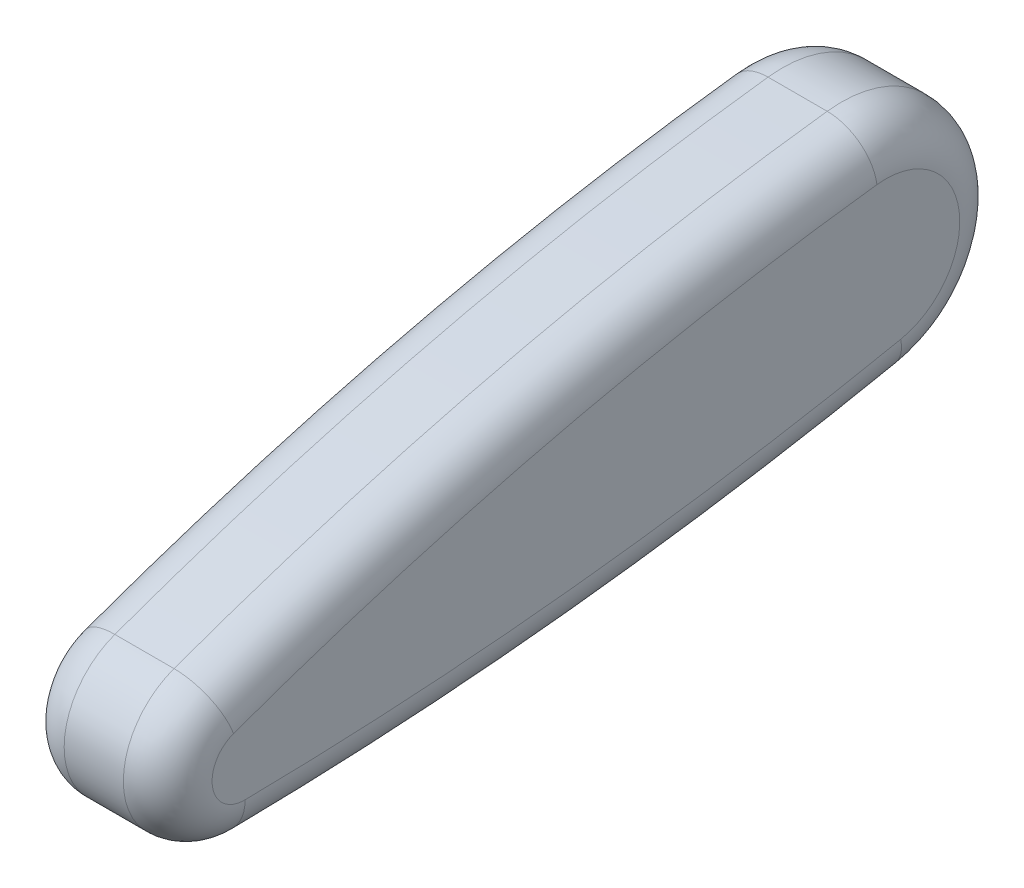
ISO-10303-21;
HEADER;
FILE_DESCRIPTION(('STEP AP214'),'2;1');
FILE_NAME('part.step','',(''),(''),'','','');
FILE_SCHEMA(('AUTOMOTIVE_DESIGN { 1 0 10303 214 1 1 1 1 }'));
ENDSEC;
DATA;
#1=APPLICATION_CONTEXT('core data for automotive mechanical design processes');
#2=APPLICATION_PROTOCOL_DEFINITION('international standard','automotive_design',2000,#1);
#3=PRODUCT_CONTEXT('',#1,'mechanical');
#4=PRODUCT('Part','Part','',(#3));
#5=PRODUCT_RELATED_PRODUCT_CATEGORY('part','',(#4));
#6=PRODUCT_DEFINITION_FORMATION('','',#4);
#7=PRODUCT_DEFINITION_CONTEXT('part definition',#1,'design');
#8=PRODUCT_DEFINITION('design','',#6,#7);
#9=PRODUCT_DEFINITION_SHAPE('','',#8);
#10=(LENGTH_UNIT() NAMED_UNIT(*) SI_UNIT(.MILLI.,.METRE.));
#11=(NAMED_UNIT(*) PLANE_ANGLE_UNIT() SI_UNIT($,.RADIAN.));
#12=(NAMED_UNIT(*) SI_UNIT($,.STERADIAN.) SOLID_ANGLE_UNIT());
#13=UNCERTAINTY_MEASURE_WITH_UNIT(LENGTH_MEASURE(1.E-05),#10,'distance_accuracy_value','');
#14=(GEOMETRIC_REPRESENTATION_CONTEXT(3) GLOBAL_UNCERTAINTY_ASSIGNED_CONTEXT((#13)) GLOBAL_UNIT_ASSIGNED_CONTEXT((#10,
#11,#12)) REPRESENTATION_CONTEXT('',''));
#15=CARTESIAN_POINT('',(0.,0.,0.));
#16=DIRECTION('',(0.,0.,1.));
#17=DIRECTION('',(1.,0.,0.));
#18=AXIS2_PLACEMENT_3D('',#15,#16,#17);
#19=CARTESIAN_POINT('',(-241.3,1358.74102949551,255.120761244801));
#20=DIRECTION('',(1.,0.,0.));
#21=DIRECTION('',(0.,0.,1.));
#22=AXIS2_PLACEMENT_3D('',#19,#20,#21);
#23=TOROIDAL_SURFACE('',#22,1504.95,19.05);
#24=CARTESIAN_POINT('',(-241.3,-146.069472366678,234.630373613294));
#25=DIRECTION('',(0.,0.0136153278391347,-0.999907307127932));
#26=DIRECTION('',(0.,-0.999907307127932,-0.0136153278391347));
#27=AXIS2_PLACEMENT_3D('',#24,#25,#26);
#28=CIRCLE('',#27,19.05);
#29=CARTESIAN_POINT('',(-222.25,-146.069472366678,234.630373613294));
#30=VERTEX_POINT('',#29);
#31=CARTESIAN_POINT('',(-241.3,-165.117706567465,234.371001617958));
#32=VERTEX_POINT('',#31);
#33=EDGE_CURVE('E11',#30,#32,#28,.T.);
#34=ORIENTED_EDGE('',*,*,#33,.T.);
#35=CARTESIAN_POINT('',(-241.3,1358.74102949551,255.120761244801));
#36=DIRECTION('',(-1.,0.,0.));
#37=DIRECTION('',(0.,0.,1.));
#38=AXIS2_PLACEMENT_3D('',#35,#36,#37);
#39=CIRCLE('',#38,1524.);
#40=CARTESIAN_POINT('',(-241.3,-134.261755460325,-50.6874860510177));
#41=VERTEX_POINT('',#40);
#42=EDGE_CURVE('E148',#32,#41,#39,.F.);
#43=ORIENTED_EDGE('',*,*,#42,.T.);
#44=CARTESIAN_POINT('',(-241.3,-115.599220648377,-46.86488295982));
#45=DIRECTION('',(0.,0.200661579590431,-0.979660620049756));
#46=DIRECTION('',(0.,-0.979660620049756,-0.200661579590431));
#47=AXIS2_PLACEMENT_3D('',#44,#45,#46);
#48=CIRCLE('',#47,19.05);
#49=CARTESIAN_POINT('',(-222.25,-115.599220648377,-46.86488295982));
#50=VERTEX_POINT('',#49);
#51=EDGE_CURVE('E40',#50,#41,#48,.T.);
#52=ORIENTED_EDGE('',*,*,#51,.F.);
#53=CARTESIAN_POINT('',(-222.25,1358.74102949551,255.120761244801));
#54=DIRECTION('',(-1.,0.,0.));
#55=DIRECTION('',(0.,0.,1.));
#56=AXIS2_PLACEMENT_3D('',#53,#54,#55);
#57=CIRCLE('',#56,1504.95);
#58=EDGE_CURVE('E125',#50,#30,#57,.T.);
#59=ORIENTED_EDGE('',*,*,#58,.T.);
#60=EDGE_LOOP('',(#34,#43,#52,#59));
#61=FACE_BOUND('',#60,.T.);
#62=ADVANCED_FACE('F33',(#61),#23,.T.);
#63=CARTESIAN_POINT('',(-241.3,-84.4949959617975,-40.4938778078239));
#64=DIRECTION('',(1.,0.,0.));
#65=DIRECTION('',(0.,0.,1.));
#66=AXIS2_PLACEMENT_3D('',#63,#64,#65);
#67=TOROIDAL_SURFACE('',#66,31.7499999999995,19.05);
#68=ORIENTED_EDGE('',*,*,#51,.T.);
#69=CARTESIAN_POINT('',(-241.3,-84.4949959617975,-40.4938778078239));
#70=DIRECTION('',(-1.,0.,0.));
#71=DIRECTION('',(0.,0.,1.));
#72=AXIS2_PLACEMENT_3D('',#69,#70,#71);
#73=CIRCLE('',#72,50.7999999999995);
#74=CARTESIAN_POINT('',(-241.3,-34.0646886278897,-34.3763536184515));
#75=VERTEX_POINT('',#74);
#76=EDGE_CURVE('E145',#41,#75,#73,.F.);
#77=ORIENTED_EDGE('',*,*,#76,.T.);
#78=CARTESIAN_POINT('',(-241.3,-52.9760538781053,-36.6704251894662));
#79=DIRECTION('',(0.,-0.120423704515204,0.992722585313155));
#80=DIRECTION('',(0.,0.992722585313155,0.120423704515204));
#81=AXIS2_PLACEMENT_3D('',#78,#79,#80);
#82=CIRCLE('',#81,19.05);
#83=CARTESIAN_POINT('',(-222.25,-52.9760538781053,-36.6704251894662));
#84=VERTEX_POINT('',#83);
#85=EDGE_CURVE('E154',#84,#75,#82,.T.);
#86=ORIENTED_EDGE('',*,*,#85,.F.);
#87=CARTESIAN_POINT('',(-222.25,-84.4949959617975,-40.4938778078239));
#88=DIRECTION('',(-1.,0.,0.));
#89=DIRECTION('',(0.,0.,1.));
#90=AXIS2_PLACEMENT_3D('',#87,#88,#89);
#91=CIRCLE('',#90,31.7499999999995);
#92=EDGE_CURVE('E133',#84,#50,#91,.T.);
#93=ORIENTED_EDGE('',*,*,#92,.T.);
#94=EDGE_LOOP('',(#68,#77,#86,#93));
#95=FACE_BOUND('',#94,.T.);
#96=ADVANCED_FACE('F159',(#95),#67,.T.);
#97=CARTESIAN_POINT('',(-241.3,-1294.8223719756,-187.314458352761));
#98=DIRECTION('',(1.,0.,0.));
#99=DIRECTION('',(0.,0.,1.));
#100=AXIS2_PLACEMENT_3D('',#97,#98,#99);
#101=TOROIDAL_SURFACE('',#100,1250.95,19.05);
#102=ORIENTED_EDGE('',*,*,#85,.T.);
#103=CARTESIAN_POINT('',(-241.3,-1294.8223719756,-187.314458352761));
#104=DIRECTION('',(-1.,0.,0.));
#105=DIRECTION('',(0.,0.,1.));
#106=AXIS2_PLACEMENT_3D('',#103,#104,#105);
#107=CIRCLE('',#106,1270.);
#108=CARTESIAN_POINT('',(-241.3,-101.063024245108,246.089071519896));
#109=VERTEX_POINT('',#108);
#110=EDGE_CURVE('E142',#75,#109,#107,.F.);
#111=ORIENTED_EDGE('',*,*,#110,.T.);
#112=CARTESIAN_POINT('',(-241.3,-118.969414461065,239.588018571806));
#113=DIRECTION('',(0.,-0.341262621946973,0.939967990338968));
#114=DIRECTION('',(0.,0.939967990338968,0.341262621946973));
#115=AXIS2_PLACEMENT_3D('',#112,#113,#114);
#116=CIRCLE('',#115,19.05);
#117=CARTESIAN_POINT('',(-222.25,-118.969414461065,239.588018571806));
#118=VERTEX_POINT('',#117);
#119=EDGE_CURVE('E151',#118,#109,#116,.T.);
#120=ORIENTED_EDGE('',*,*,#119,.F.);
#121=CARTESIAN_POINT('',(-222.25,-1294.8223719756,-187.314458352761));
#122=DIRECTION('',(-1.,0.,0.));
#123=DIRECTION('',(0.,0.,1.));
#124=AXIS2_PLACEMENT_3D('',#121,#122,#123);
#125=CIRCLE('',#124,1250.95);
#126=EDGE_CURVE('E135',#118,#84,#125,.T.);
#127=ORIENTED_EDGE('',*,*,#126,.T.);
#128=EDGE_LOOP('',(#102,#111,#120,#127));
#129=FACE_BOUND('',#128,.T.);
#130=ADVANCED_FACE('F210',(#129),#101,.T.);
#131=CARTESIAN_POINT('',(-241.3,-132.100767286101,234.820579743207));
#132=DIRECTION('',(1.,0.,0.));
#133=DIRECTION('',(0.,0.,1.));
#134=AXIS2_PLACEMENT_3D('',#131,#132,#133);
#135=DEGENERATE_TOROIDAL_SURFACE('',#134,13.9699999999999,19.05,.T.);
#136=CARTESIAN_POINT('',(-222.25,-132.100767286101,234.820579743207));
#137=DIRECTION('',(-1.,0.,0.));
#138=DIRECTION('',(0.,0.,1.));
#139=AXIS2_PLACEMENT_3D('',#136,#137,#138);
#140=CIRCLE('',#139,13.9699999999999);
#141=EDGE_CURVE('E137',#30,#118,#140,.T.);
#142=ORIENTED_EDGE('',*,*,#141,.T.);
#143=ORIENTED_EDGE('',*,*,#119,.T.);
#144=CARTESIAN_POINT('',(-241.3,-132.100767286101,234.820579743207));
#145=DIRECTION('',(-1.,0.,0.));
#146=DIRECTION('',(0.,0.,1.));
#147=AXIS2_PLACEMENT_3D('',#144,#145,#146);
#148=CIRCLE('',#147,33.0199999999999);
#149=EDGE_CURVE('E139',#109,#32,#148,.F.);
#150=ORIENTED_EDGE('',*,*,#149,.T.);
#151=ORIENTED_EDGE('',*,*,#33,.F.);
#152=EDGE_LOOP('',(#142,#143,#150,#151));
#153=FACE_BOUND('',#152,.T.);
#154=ADVANCED_FACE('F214',(#153),#135,.T.);
#155=CARTESIAN_POINT('',(-266.7,1358.74102949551,255.120761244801));
#156=DIRECTION('',(1.,0.,0.));
#157=DIRECTION('',(0.,0.,1.));
#158=AXIS2_PLACEMENT_3D('',#155,#156,#157);
#159=TOROIDAL_SURFACE('',#158,1504.95,19.05);
#160=CARTESIAN_POINT('',(-266.7,-115.599220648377,-46.86488295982));
#161=DIRECTION('',(0.,-0.200661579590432,0.979660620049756));
#162=DIRECTION('',(0.,0.979660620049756,0.200661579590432));
#163=AXIS2_PLACEMENT_3D('',#160,#161,#162);
#164=CIRCLE('',#163,19.05);
#165=CARTESIAN_POINT('',(-285.75,-115.599220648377,-46.86488295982));
#166=VERTEX_POINT('',#165);
#167=CARTESIAN_POINT('',(-266.7,-134.261755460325,-50.6874860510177));
#168=VERTEX_POINT('',#167);
#169=EDGE_CURVE('E123',#166,#168,#164,.T.);
#170=ORIENTED_EDGE('',*,*,#169,.T.);
#171=CARTESIAN_POINT('',(-266.7,1358.74102949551,255.120761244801));
#172=DIRECTION('',(-1.,0.,0.));
#173=DIRECTION('',(0.,0.,1.));
#174=AXIS2_PLACEMENT_3D('',#171,#172,#173);
#175=CIRCLE('',#174,1524.);
#176=CARTESIAN_POINT('',(-266.7,-165.117706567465,234.371001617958));
#177=VERTEX_POINT('',#176);
#178=EDGE_CURVE('E122',#168,#177,#175,.T.);
#179=ORIENTED_EDGE('',*,*,#178,.T.);
#180=CARTESIAN_POINT('',(-266.7,-146.069472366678,234.630373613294));
#181=DIRECTION('',(0.,-0.0136153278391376,0.999907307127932));
#182=DIRECTION('',(0.,0.999907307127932,0.0136153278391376));
#183=AXIS2_PLACEMENT_3D('',#180,#181,#182);
#184=CIRCLE('',#183,19.05);
#185=CARTESIAN_POINT('',(-285.75,-146.069472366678,234.630373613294));
#186=VERTEX_POINT('',#185);
#187=EDGE_CURVE('E104',#186,#177,#184,.T.);
#188=ORIENTED_EDGE('',*,*,#187,.F.);
#189=CARTESIAN_POINT('',(-285.75,1358.74102949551,255.120761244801));
#190=DIRECTION('',(-1.,0.,0.));
#191=DIRECTION('',(0.,0.,1.));
#192=AXIS2_PLACEMENT_3D('',#189,#190,#191);
#193=CIRCLE('',#192,1504.95);
#194=EDGE_CURVE('E111',#186,#166,#193,.F.);
#195=ORIENTED_EDGE('',*,*,#194,.T.);
#196=EDGE_LOOP('',(#170,#179,#188,#195));
#197=FACE_BOUND('',#196,.T.);
#198=ADVANCED_FACE('F121',(#197),#159,.T.);
#199=CARTESIAN_POINT('',(-266.7,-132.100767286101,234.820579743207));
#200=DIRECTION('',(1.,0.,0.));
#201=DIRECTION('',(0.,0.,1.));
#202=AXIS2_PLACEMENT_3D('',#199,#200,#201);
#203=DEGENERATE_TOROIDAL_SURFACE('',#202,13.9699999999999,19.05,.T.);
#204=ORIENTED_EDGE('',*,*,#187,.T.);
#205=CARTESIAN_POINT('',(-266.7,-132.100767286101,234.820579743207));
#206=DIRECTION('',(-1.,0.,0.));
#207=DIRECTION('',(0.,0.,1.));
#208=AXIS2_PLACEMENT_3D('',#205,#206,#207);
#209=CIRCLE('',#208,33.0199999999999);
#210=CARTESIAN_POINT('',(-266.7,-101.063024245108,246.089071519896));
#211=VERTEX_POINT('',#210);
#212=EDGE_CURVE('E171',#177,#211,#209,.T.);
#213=ORIENTED_EDGE('',*,*,#212,.T.);
#214=CARTESIAN_POINT('',(-266.7,-118.969414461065,239.588018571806));
#215=DIRECTION('',(0.,0.341262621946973,-0.939967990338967));
#216=DIRECTION('',(0.,-0.939967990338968,-0.341262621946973));
#217=AXIS2_PLACEMENT_3D('',#214,#215,#216);
#218=CIRCLE('',#217,19.05);
#219=CARTESIAN_POINT('',(-285.75,-118.969414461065,239.588018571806));
#220=VERTEX_POINT('',#219);
#221=EDGE_CURVE('E107',#220,#211,#218,.T.);
#222=ORIENTED_EDGE('',*,*,#221,.F.);
#223=CARTESIAN_POINT('',(-285.75,-132.100767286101,234.820579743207));
#224=DIRECTION('',(-1.,0.,0.));
#225=DIRECTION('',(0.,0.,1.));
#226=AXIS2_PLACEMENT_3D('',#223,#224,#225);
#227=CIRCLE('',#226,13.9699999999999);
#228=EDGE_CURVE('E99',#220,#186,#227,.F.);
#229=ORIENTED_EDGE('',*,*,#228,.T.);
#230=EDGE_LOOP('',(#204,#213,#222,#229));
#231=FACE_BOUND('',#230,.T.);
#232=ADVANCED_FACE('F101',(#231),#203,.T.);
#233=CARTESIAN_POINT('',(-266.7,-1294.8223719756,-187.314458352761));
#234=DIRECTION('',(1.,0.,0.));
#235=DIRECTION('',(0.,0.,1.));
#236=AXIS2_PLACEMENT_3D('',#233,#234,#235);
#237=TOROIDAL_SURFACE('',#236,1250.95,19.05);
#238=ORIENTED_EDGE('',*,*,#221,.T.);
#239=CARTESIAN_POINT('',(-266.7,-1294.8223719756,-187.314458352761));
#240=DIRECTION('',(-1.,0.,0.));
#241=DIRECTION('',(0.,0.,1.));
#242=AXIS2_PLACEMENT_3D('',#239,#240,#241);
#243=CIRCLE('',#242,1270.);
#244=CARTESIAN_POINT('',(-266.7,-34.0646886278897,-34.3763536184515));
#245=VERTEX_POINT('',#244);
#246=EDGE_CURVE('E174',#211,#245,#243,.T.);
#247=ORIENTED_EDGE('',*,*,#246,.T.);
#248=CARTESIAN_POINT('',(-266.7,-52.9760538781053,-36.6704251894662));
#249=DIRECTION('',(0.,0.120423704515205,-0.992722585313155));
#250=DIRECTION('',(0.,-0.992722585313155,-0.120423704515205));
#251=AXIS2_PLACEMENT_3D('',#248,#249,#250);
#252=CIRCLE('',#251,19.05);
#253=CARTESIAN_POINT('',(-285.75,-52.9760538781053,-36.6704251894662));
#254=VERTEX_POINT('',#253);
#255=EDGE_CURVE('E127',#254,#245,#252,.T.);
#256=ORIENTED_EDGE('',*,*,#255,.F.);
#257=CARTESIAN_POINT('',(-285.75,-1294.8223719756,-187.314458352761));
#258=DIRECTION('',(-1.,0.,0.));
#259=DIRECTION('',(0.,0.,1.));
#260=AXIS2_PLACEMENT_3D('',#257,#258,#259);
#261=CIRCLE('',#260,1250.95);
#262=EDGE_CURVE('E110',#254,#220,#261,.F.);
#263=ORIENTED_EDGE('',*,*,#262,.T.);
#264=EDGE_LOOP('',(#238,#247,#256,#263));
#265=FACE_BOUND('',#264,.T.);
#266=ADVANCED_FACE('F187',(#265),#237,.T.);
#267=CARTESIAN_POINT('',(-266.7,-84.4949959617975,-40.4938778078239));
#268=DIRECTION('',(1.,0.,0.));
#269=DIRECTION('',(0.,0.,1.));
#270=AXIS2_PLACEMENT_3D('',#267,#268,#269);
#271=TOROIDAL_SURFACE('',#270,31.7499999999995,19.05);
#272=CARTESIAN_POINT('',(-285.75,-84.4949959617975,-40.4938778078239));
#273=DIRECTION('',(-1.,0.,0.));
#274=DIRECTION('',(0.,0.,1.));
#275=AXIS2_PLACEMENT_3D('',#272,#273,#274);
#276=CIRCLE('',#275,31.7499999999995);
#277=EDGE_CURVE('E115',#166,#254,#276,.F.);
#278=ORIENTED_EDGE('',*,*,#277,.T.);
#279=ORIENTED_EDGE('',*,*,#255,.T.);
#280=CARTESIAN_POINT('',(-266.7,-84.4949959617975,-40.4938778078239));
#281=DIRECTION('',(-1.,0.,0.));
#282=DIRECTION('',(0.,0.,1.));
#283=AXIS2_PLACEMENT_3D('',#280,#281,#282);
#284=CIRCLE('',#283,50.7999999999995);
#285=EDGE_CURVE('E178',#245,#168,#284,.T.);
#286=ORIENTED_EDGE('',*,*,#285,.T.);
#287=ORIENTED_EDGE('',*,*,#169,.F.);
#288=EDGE_LOOP('',(#278,#279,#286,#287));
#289=FACE_BOUND('',#288,.T.);
#290=ADVANCED_FACE('F185',(#289),#271,.T.);
#291=CARTESIAN_POINT('',(-285.75,-1294.8223719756,-187.314458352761));
#292=DIRECTION('',(1.,0.,0.));
#293=DIRECTION('',(0.,0.,1.));
#294=AXIS2_PLACEMENT_3D('',#291,#292,#293);
#295=CYLINDRICAL_SURFACE('',#294,1270.);
#296=DIRECTION('',(1.,0.,0.));
#297=VECTOR('',#296,1.);
#298=CARTESIAN_POINT('',(-285.75,-34.0646886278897,-34.3763536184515));
#299=LINE('',#298,#297);
#300=EDGE_CURVE('E54',#245,#75,#299,.T.);
#301=ORIENTED_EDGE('',*,*,#300,.F.);
#302=ORIENTED_EDGE('',*,*,#246,.F.);
#303=DIRECTION('',(1.,0.,0.));
#304=VECTOR('',#303,1.);
#305=CARTESIAN_POINT('',(-285.75,-101.063024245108,246.089071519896));
#306=LINE('',#305,#304);
#307=EDGE_CURVE('E119',#211,#109,#306,.T.);
#308=ORIENTED_EDGE('',*,*,#307,.T.);
#309=ORIENTED_EDGE('',*,*,#110,.F.);
#310=EDGE_LOOP('',(#301,#302,#308,#309));
#311=FACE_BOUND('',#310,.T.);
#312=ADVANCED_FACE('F189',(#311),#295,.T.);
#313=CARTESIAN_POINT('',(-285.75,-132.100767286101,234.820579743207));
#314=DIRECTION('',(1.,0.,0.));
#315=DIRECTION('',(0.,0.,1.));
#316=AXIS2_PLACEMENT_3D('',#313,#314,#315);
#317=CYLINDRICAL_SURFACE('',#316,33.0199999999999);
#318=ORIENTED_EDGE('',*,*,#307,.F.);
#319=ORIENTED_EDGE('',*,*,#212,.F.);
#320=DIRECTION('',(1.,0.,0.));
#321=VECTOR('',#320,1.);
#322=CARTESIAN_POINT('',(-285.75,-165.117706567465,234.371001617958));
#323=LINE('',#322,#321);
#324=EDGE_CURVE('E166',#177,#32,#323,.T.);
#325=ORIENTED_EDGE('',*,*,#324,.T.);
#326=ORIENTED_EDGE('',*,*,#149,.F.);
#327=EDGE_LOOP('',(#318,#319,#325,#326));
#328=FACE_BOUND('',#327,.T.);
#329=ADVANCED_FACE('F172',(#328),#317,.T.);
#330=CARTESIAN_POINT('',(-285.75,1358.74102949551,255.120761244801));
#331=DIRECTION('',(1.,0.,0.));
#332=DIRECTION('',(0.,0.,1.));
#333=AXIS2_PLACEMENT_3D('',#330,#331,#332);
#334=CYLINDRICAL_SURFACE('',#333,1524.);
#335=ORIENTED_EDGE('',*,*,#324,.F.);
#336=ORIENTED_EDGE('',*,*,#178,.F.);
#337=DIRECTION('',(1.,0.,0.));
#338=VECTOR('',#337,1.);
#339=CARTESIAN_POINT('',(-285.75,-134.261755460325,-50.6874860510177));
#340=LINE('',#339,#338);
#341=EDGE_CURVE('E47',#168,#41,#340,.T.);
#342=ORIENTED_EDGE('',*,*,#341,.T.);
#343=ORIENTED_EDGE('',*,*,#42,.F.);
#344=EDGE_LOOP('',(#335,#336,#342,#343));
#345=FACE_BOUND('',#344,.T.);
#346=ADVANCED_FACE('F165',(#345),#334,.T.);
#347=CARTESIAN_POINT('',(-285.75,-84.4949959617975,-40.4938778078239));
#348=DIRECTION('',(1.,0.,0.));
#349=DIRECTION('',(0.,0.,1.));
#350=AXIS2_PLACEMENT_3D('',#347,#348,#349);
#351=CYLINDRICAL_SURFACE('',#350,50.7999999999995);
#352=ORIENTED_EDGE('',*,*,#341,.F.);
#353=ORIENTED_EDGE('',*,*,#285,.F.);
#354=ORIENTED_EDGE('',*,*,#300,.T.);
#355=ORIENTED_EDGE('',*,*,#76,.F.);
#356=EDGE_LOOP('',(#352,#353,#354,#355));
#357=FACE_BOUND('',#356,.T.);
#358=ADVANCED_FACE('F191',(#357),#351,.T.);
#359=CARTESIAN_POINT('',(-285.75,-689.658683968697,-113.904168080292));
#360=DIRECTION('',(1.,0.,0.));
#361=DIRECTION('',(0.,0.,1.));
#362=AXIS2_PLACEMENT_3D('',#359,#360,#361);
#363=PLANE('',#362);
#364=ORIENTED_EDGE('',*,*,#194,.F.);
#365=ORIENTED_EDGE('',*,*,#228,.F.);
#366=ORIENTED_EDGE('',*,*,#262,.F.);
#367=ORIENTED_EDGE('',*,*,#277,.F.);
#368=EDGE_LOOP('',(#364,#365,#366,#367));
#369=FACE_BOUND('',#368,.T.);
#370=ADVANCED_FACE('F114',(#369),#363,.F.);
#371=CARTESIAN_POINT('',(-222.25,-689.658683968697,-113.904168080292));
#372=DIRECTION('',(1.,0.,0.));
#373=DIRECTION('',(0.,0.,1.));
#374=AXIS2_PLACEMENT_3D('',#371,#372,#373);
#375=PLANE('',#374);
#376=ORIENTED_EDGE('',*,*,#58,.F.);
#377=ORIENTED_EDGE('',*,*,#92,.F.);
#378=ORIENTED_EDGE('',*,*,#126,.F.);
#379=ORIENTED_EDGE('',*,*,#141,.F.);
#380=EDGE_LOOP('',(#376,#377,#378,#379));
#381=FACE_BOUND('',#380,.T.);
#382=ADVANCED_FACE('F202',(#381),#375,.T.);
#383=CLOSED_SHELL('',(#62,#96,#130,#154,#198,#232,#266,#290,#312,#329,#346,#358,#370,#382));
#384=MANIFOLD_SOLID_BREP('B2',#383);
#385=ADVANCED_BREP_SHAPE_REPRESENTATION('',(#18,#384),#14);
#386=SHAPE_DEFINITION_REPRESENTATION(#9,#385);
ENDSEC;
END-ISO-10303-21;
